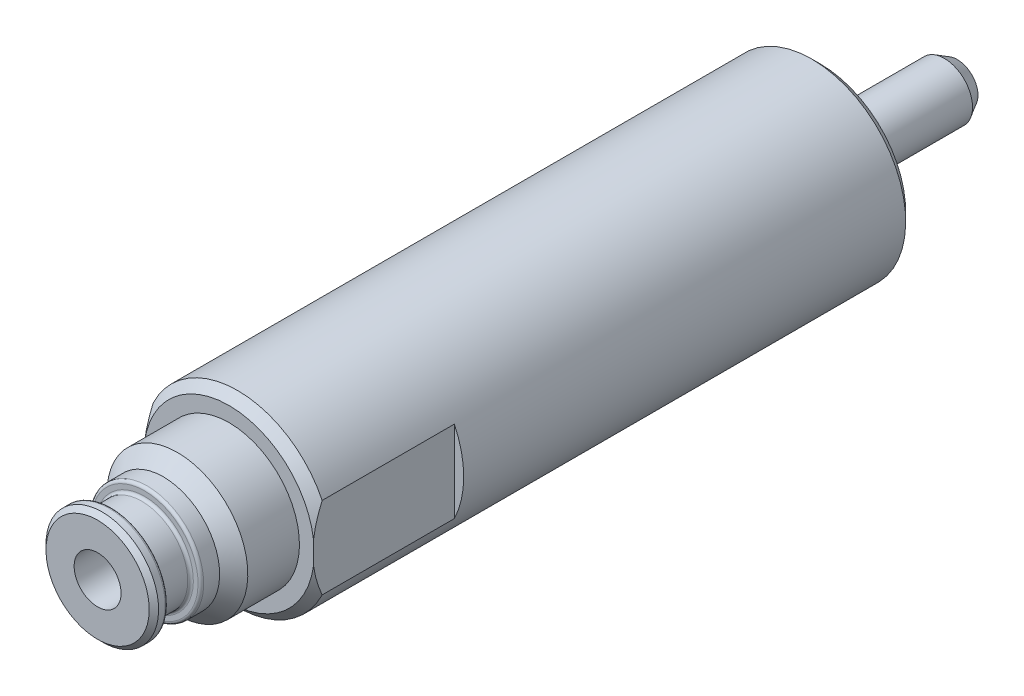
ISO-10303-21;
HEADER;
FILE_DESCRIPTION(('STEP AP214'),'2;1');
FILE_NAME('part.step','',(''),(''),'','','');
FILE_SCHEMA(('AUTOMOTIVE_DESIGN { 1 0 10303 214 1 1 1 1 }'));
ENDSEC;
DATA;
#1=APPLICATION_CONTEXT('core data for automotive mechanical design processes');
#2=APPLICATION_PROTOCOL_DEFINITION('international standard','automotive_design',2000,#1);
#3=PRODUCT_CONTEXT('',#1,'mechanical');
#4=PRODUCT('Part','Part','',(#3));
#5=PRODUCT_RELATED_PRODUCT_CATEGORY('part','',(#4));
#6=PRODUCT_DEFINITION_FORMATION('','',#4);
#7=PRODUCT_DEFINITION_CONTEXT('part definition',#1,'design');
#8=PRODUCT_DEFINITION('design','',#6,#7);
#9=PRODUCT_DEFINITION_SHAPE('','',#8);
#10=(LENGTH_UNIT() NAMED_UNIT(*) SI_UNIT(.MILLI.,.METRE.));
#11=(NAMED_UNIT(*) PLANE_ANGLE_UNIT() SI_UNIT($,.RADIAN.));
#12=(NAMED_UNIT(*) SI_UNIT($,.STERADIAN.) SOLID_ANGLE_UNIT());
#13=UNCERTAINTY_MEASURE_WITH_UNIT(LENGTH_MEASURE(1.E-05),#10,'distance_accuracy_value','');
#14=(GEOMETRIC_REPRESENTATION_CONTEXT(3) GLOBAL_UNCERTAINTY_ASSIGNED_CONTEXT((#13)) GLOBAL_UNIT_ASSIGNED_CONTEXT((#10,
#11,#12)) REPRESENTATION_CONTEXT('',''));
#15=CARTESIAN_POINT('',(0.,0.,0.));
#16=DIRECTION('',(0.,0.,1.));
#17=DIRECTION('',(1.,0.,0.));
#18=AXIS2_PLACEMENT_3D('',#15,#16,#17);
#19=CARTESIAN_POINT('',(0.,0.,0.));
#20=DIRECTION('',(0.,0.,-1.));
#21=DIRECTION('',(-1.,0.,0.));
#22=AXIS2_PLACEMENT_3D('',#19,#20,#21);
#23=CYLINDRICAL_SURFACE('',#22,3.);
#24=CARTESIAN_POINT('',(0.,0.,-13.2));
#25=DIRECTION('',(0.,0.,1.));
#26=DIRECTION('',(1.,0.,0.));
#27=AXIS2_PLACEMENT_3D('',#24,#25,#26);
#28=CIRCLE('',#27,3.);
#29=CARTESIAN_POINT('',(3.,0.,-13.2));
#30=VERTEX_POINT('',#29);
#31=EDGE_CURVE('E23',#30,#30,#28,.T.);
#32=ORIENTED_EDGE('',*,*,#31,.T.);
#33=EDGE_LOOP('',(#32));
#34=FACE_BOUND('',#33,.T.);
#35=CARTESIAN_POINT('',(0.,0.,0.));
#36=DIRECTION('',(0.,0.,1.));
#37=DIRECTION('',(1.,0.,0.));
#38=AXIS2_PLACEMENT_3D('',#35,#36,#37);
#39=CIRCLE('',#38,3.);
#40=CARTESIAN_POINT('',(3.,0.,0.));
#41=VERTEX_POINT('',#40);
#42=EDGE_CURVE('E108',#41,#41,#39,.T.);
#43=ORIENTED_EDGE('',*,*,#42,.F.);
#44=EDGE_LOOP('',(#43));
#45=FACE_BOUND('',#44,.T.);
#46=ADVANCED_FACE('F14',(#34,#45),#23,.T.);
#47=CARTESIAN_POINT('',(0.,0.,-9.));
#48=DIRECTION('',(0.,0.,-1.));
#49=DIRECTION('',(-1.,0.,0.));
#50=AXIS2_PLACEMENT_3D('',#47,#48,#49);
#51=SPHERICAL_SURFACE('',#50,6.);
#52=CARTESIAN_POINT('',(0.,0.,-14.5810746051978));
#53=DIRECTION('',(0.,0.,-1.));
#54=DIRECTION('',(0.,1.,0.));
#55=AXIS2_PLACEMENT_3D('',#52,#53,#54);
#56=CIRCLE('',#55,2.20263620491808);
#57=CARTESIAN_POINT('',(0.,2.20263620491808,-14.5810746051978));
#58=VERTEX_POINT('',#57);
#59=EDGE_CURVE('E9',#58,#58,#56,.T.);
#60=ORIENTED_EDGE('',*,*,#59,.T.);
#61=EDGE_LOOP('',(#60));
#62=FACE_BOUND('',#61,.T.);
#63=ADVANCED_FACE('F413',(#62),#51,.T.);
#64=CARTESIAN_POINT('',(0.,0.,-13.2));
#65=DIRECTION('',(0.,0.,1.));
#66=DIRECTION('',(0.,-1.,0.));
#67=AXIS2_PLACEMENT_3D('',#64,#65,#66);
#68=CONICAL_SURFACE('',#67,3.,0.523598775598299);
#69=ORIENTED_EDGE('',*,*,#59,.F.);
#70=EDGE_LOOP('',(#69));
#71=FACE_BOUND('',#70,.T.);
#72=ORIENTED_EDGE('',*,*,#31,.F.);
#73=EDGE_LOOP('',(#72));
#74=FACE_BOUND('',#73,.T.);
#75=ADVANCED_FACE('F287',(#71,#74),#68,.T.);
#76=CARTESIAN_POINT('',(2.067,0.,77.));
#77=DIRECTION('',(0.,0.,-1.));
#78=DIRECTION('',(0.,1.,0.));
#79=AXIS2_PLACEMENT_3D('',#76,#77,#78);
#80=PLANE('',#79);
#81=CARTESIAN_POINT('',(0.,0.,77.));
#82=DIRECTION('',(0.,0.,1.));
#83=DIRECTION('',(1.,0.,0.));
#84=AXIS2_PLACEMENT_3D('',#81,#82,#83);
#85=CIRCLE('',#84,2.5);
#86=CARTESIAN_POINT('',(2.5,0.,77.));
#87=VERTEX_POINT('',#86);
#88=EDGE_CURVE('E440',#87,#87,#85,.T.);
#89=ORIENTED_EDGE('',*,*,#88,.F.);
#90=EDGE_LOOP('',(#89));
#91=FACE_BOUND('',#90,.T.);
#92=CARTESIAN_POINT('',(0.,0.,77.));
#93=DIRECTION('',(0.,0.,-1.));
#94=DIRECTION('',(0.,1.,0.));
#95=AXIS2_PLACEMENT_3D('',#92,#93,#94);
#96=CIRCLE('',#95,5.5);
#97=CARTESIAN_POINT('',(0.,5.5,77.));
#98=VERTEX_POINT('',#97);
#99=EDGE_CURVE('E154',#98,#98,#96,.T.);
#100=ORIENTED_EDGE('',*,*,#99,.F.);
#101=EDGE_LOOP('',(#100));
#102=FACE_BOUND('',#101,.T.);
#103=ADVANCED_FACE('F275',(#91,#102),#80,.F.);
#104=CARTESIAN_POINT('',(0.,0.,77.));
#105=DIRECTION('',(0.,0.,-1.));
#106=DIRECTION('',(0.,1.,0.));
#107=AXIS2_PLACEMENT_3D('',#104,#105,#106);
#108=CONICAL_SURFACE('',#107,5.5,0.785398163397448);
#109=CARTESIAN_POINT('',(0.,0.,76.5));
#110=DIRECTION('',(0.,0.,-1.));
#111=DIRECTION('',(0.,1.,0.));
#112=AXIS2_PLACEMENT_3D('',#109,#110,#111);
#113=CIRCLE('',#112,6.);
#114=CARTESIAN_POINT('',(0.,6.,76.5));
#115=VERTEX_POINT('',#114);
#116=EDGE_CURVE('E151',#115,#115,#113,.T.);
#117=ORIENTED_EDGE('',*,*,#116,.F.);
#118=EDGE_LOOP('',(#117));
#119=FACE_BOUND('',#118,.T.);
#120=ORIENTED_EDGE('',*,*,#99,.T.);
#121=EDGE_LOOP('',(#120));
#122=FACE_BOUND('',#121,.T.);
#123=ADVANCED_FACE('F305',(#119,#122),#108,.T.);
#124=CARTESIAN_POINT('',(0.,0.,54.5));
#125=DIRECTION('',(0.,0.,-1.));
#126=DIRECTION('',(0.,1.,0.));
#127=AXIS2_PLACEMENT_3D('',#124,#125,#126);
#128=CYLINDRICAL_SURFACE('',#127,6.);
#129=CARTESIAN_POINT('',(0.,0.,75.8));
#130=DIRECTION('',(0.,0.,-1.));
#131=DIRECTION('',(0.,1.,0.));
#132=AXIS2_PLACEMENT_3D('',#129,#130,#131);
#133=CIRCLE('',#132,6.);
#134=CARTESIAN_POINT('',(0.,6.,75.8));
#135=VERTEX_POINT('',#134);
#136=EDGE_CURVE('E148',#135,#135,#133,.T.);
#137=ORIENTED_EDGE('',*,*,#136,.F.);
#138=EDGE_LOOP('',(#137));
#139=FACE_BOUND('',#138,.T.);
#140=ORIENTED_EDGE('',*,*,#116,.T.);
#141=EDGE_LOOP('',(#140));
#142=FACE_BOUND('',#141,.T.);
#143=ADVANCED_FACE('F310',(#139,#142),#128,.T.);
#144=CARTESIAN_POINT('',(0.,0.,75.8));
#145=DIRECTION('',(0.,0.,-1.));
#146=DIRECTION('',(0.,1.,0.));
#147=AXIS2_PLACEMENT_3D('',#144,#145,#146);
#148=TOROIDAL_SURFACE('',#147,5.7,0.300000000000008);
#149=ORIENTED_EDGE('',*,*,#136,.T.);
#150=EDGE_LOOP('',(#149));
#151=FACE_BOUND('',#150,.T.);
#152=CARTESIAN_POINT('',(0.,0.,75.5));
#153=DIRECTION('',(0.,0.,-1.));
#154=DIRECTION('',(0.,1.,0.));
#155=AXIS2_PLACEMENT_3D('',#152,#153,#154);
#156=CIRCLE('',#155,5.7);
#157=CARTESIAN_POINT('',(0.,5.7,75.5));
#158=VERTEX_POINT('',#157);
#159=EDGE_CURVE('E145',#158,#158,#156,.T.);
#160=ORIENTED_EDGE('',*,*,#159,.F.);
#161=EDGE_LOOP('',(#160));
#162=FACE_BOUND('',#161,.T.);
#163=ADVANCED_FACE('F319',(#151,#162),#148,.T.);
#164=CARTESIAN_POINT('',(5.7,0.,75.5));
#165=DIRECTION('',(0.,0.,1.));
#166=DIRECTION('',(0.,-1.,0.));
#167=AXIS2_PLACEMENT_3D('',#164,#165,#166);
#168=PLANE('',#167);
#169=CARTESIAN_POINT('',(0.,0.,75.5));
#170=DIRECTION('',(0.,0.,-1.));
#171=DIRECTION('',(0.,1.,0.));
#172=AXIS2_PLACEMENT_3D('',#169,#170,#171);
#173=CIRCLE('',#172,5.2);
#174=CARTESIAN_POINT('',(0.,5.2,75.5));
#175=VERTEX_POINT('',#174);
#176=EDGE_CURVE('E142',#175,#175,#173,.T.);
#177=ORIENTED_EDGE('',*,*,#176,.F.);
#178=EDGE_LOOP('',(#177));
#179=FACE_BOUND('',#178,.T.);
#180=ORIENTED_EDGE('',*,*,#159,.T.);
#181=EDGE_LOOP('',(#180));
#182=FACE_BOUND('',#181,.T.);
#183=ADVANCED_FACE('F327',(#179,#182),#168,.F.);
#184=CARTESIAN_POINT('',(0.,0.,75.2));
#185=DIRECTION('',(0.,0.,-1.));
#186=DIRECTION('',(0.,1.,0.));
#187=AXIS2_PLACEMENT_3D('',#184,#185,#186);
#188=TOROIDAL_SURFACE('',#187,5.2,0.299999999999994);
#189=CARTESIAN_POINT('',(0.,0.,75.2));
#190=DIRECTION('',(0.,0.,-1.));
#191=DIRECTION('',(0.,1.,0.));
#192=AXIS2_PLACEMENT_3D('',#189,#190,#191);
#193=CIRCLE('',#192,4.9);
#194=CARTESIAN_POINT('',(0.,4.9,75.2));
#195=VERTEX_POINT('',#194);
#196=EDGE_CURVE('E139',#195,#195,#193,.T.);
#197=ORIENTED_EDGE('',*,*,#196,.F.);
#198=EDGE_LOOP('',(#197));
#199=FACE_BOUND('',#198,.T.);
#200=ORIENTED_EDGE('',*,*,#176,.T.);
#201=EDGE_LOOP('',(#200));
#202=FACE_BOUND('',#201,.T.);
#203=ADVANCED_FACE('F335',(#199,#202),#188,.F.);
#204=CARTESIAN_POINT('',(0.,0.,54.5));
#205=DIRECTION('',(0.,0.,-1.));
#206=DIRECTION('',(0.,1.,0.));
#207=AXIS2_PLACEMENT_3D('',#204,#205,#206);
#208=CYLINDRICAL_SURFACE('',#207,4.9);
#209=CARTESIAN_POINT('',(0.,0.,72.3));
#210=DIRECTION('',(0.,0.,-1.));
#211=DIRECTION('',(0.,1.,0.));
#212=AXIS2_PLACEMENT_3D('',#209,#210,#211);
#213=CIRCLE('',#212,4.9);
#214=CARTESIAN_POINT('',(0.,4.9,72.3));
#215=VERTEX_POINT('',#214);
#216=EDGE_CURVE('E136',#215,#215,#213,.T.);
#217=ORIENTED_EDGE('',*,*,#216,.F.);
#218=EDGE_LOOP('',(#217));
#219=FACE_BOUND('',#218,.T.);
#220=ORIENTED_EDGE('',*,*,#196,.T.);
#221=EDGE_LOOP('',(#220));
#222=FACE_BOUND('',#221,.T.);
#223=ADVANCED_FACE('F343',(#219,#222),#208,.T.);
#224=CARTESIAN_POINT('',(0.,0.,72.3));
#225=DIRECTION('',(0.,0.,-1.));
#226=DIRECTION('',(0.,1.,0.));
#227=AXIS2_PLACEMENT_3D('',#224,#225,#226);
#228=TOROIDAL_SURFACE('',#227,5.2,0.29999999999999);
#229=CARTESIAN_POINT('',(0.,0.,72.));
#230=DIRECTION('',(0.,0.,-1.));
#231=DIRECTION('',(0.,1.,0.));
#232=AXIS2_PLACEMENT_3D('',#229,#230,#231);
#233=CIRCLE('',#232,5.2);
#234=CARTESIAN_POINT('',(0.,5.2,72.));
#235=VERTEX_POINT('',#234);
#236=EDGE_CURVE('E133',#235,#235,#233,.T.);
#237=ORIENTED_EDGE('',*,*,#236,.F.);
#238=EDGE_LOOP('',(#237));
#239=FACE_BOUND('',#238,.T.);
#240=ORIENTED_EDGE('',*,*,#216,.T.);
#241=EDGE_LOOP('',(#240));
#242=FACE_BOUND('',#241,.T.);
#243=ADVANCED_FACE('F351',(#239,#242),#228,.F.);
#244=CARTESIAN_POINT('',(5.2,0.,72.));
#245=DIRECTION('',(0.,0.,-1.));
#246=DIRECTION('',(0.,1.,0.));
#247=AXIS2_PLACEMENT_3D('',#244,#245,#246);
#248=PLANE('',#247);
#249=CARTESIAN_POINT('',(0.,0.,72.));
#250=DIRECTION('',(0.,0.,-1.));
#251=DIRECTION('',(0.,1.,0.));
#252=AXIS2_PLACEMENT_3D('',#249,#250,#251);
#253=CIRCLE('',#252,5.7);
#254=CARTESIAN_POINT('',(0.,5.7,72.));
#255=VERTEX_POINT('',#254);
#256=EDGE_CURVE('E130',#255,#255,#253,.T.);
#257=ORIENTED_EDGE('',*,*,#256,.F.);
#258=EDGE_LOOP('',(#257));
#259=FACE_BOUND('',#258,.T.);
#260=ORIENTED_EDGE('',*,*,#236,.T.);
#261=EDGE_LOOP('',(#260));
#262=FACE_BOUND('',#261,.T.);
#263=ADVANCED_FACE('F359',(#259,#262),#248,.F.);
#264=CARTESIAN_POINT('',(0.,0.,71.7));
#265=DIRECTION('',(0.,0.,-1.));
#266=DIRECTION('',(0.,1.,0.));
#267=AXIS2_PLACEMENT_3D('',#264,#265,#266);
#268=TOROIDAL_SURFACE('',#267,5.7,0.300000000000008);
#269=ORIENTED_EDGE('',*,*,#256,.T.);
#270=EDGE_LOOP('',(#269));
#271=FACE_BOUND('',#270,.T.);
#272=CARTESIAN_POINT('',(0.,0.,71.7));
#273=DIRECTION('',(0.,0.,-1.));
#274=DIRECTION('',(0.,1.,0.));
#275=AXIS2_PLACEMENT_3D('',#272,#273,#274);
#276=CIRCLE('',#275,6.);
#277=CARTESIAN_POINT('',(0.,6.,71.7));
#278=VERTEX_POINT('',#277);
#279=EDGE_CURVE('E127',#278,#278,#276,.T.);
#280=ORIENTED_EDGE('',*,*,#279,.F.);
#281=EDGE_LOOP('',(#280));
#282=FACE_BOUND('',#281,.T.);
#283=ADVANCED_FACE('F367',(#271,#282),#268,.T.);
#284=CARTESIAN_POINT('',(0.,0.,54.5));
#285=DIRECTION('',(0.,0.,-1.));
#286=DIRECTION('',(0.,1.,0.));
#287=AXIS2_PLACEMENT_3D('',#284,#285,#286);
#288=CYLINDRICAL_SURFACE('',#287,6.);
#289=CARTESIAN_POINT('',(0.,0.,70.));
#290=DIRECTION('',(0.,0.,-1.));
#291=DIRECTION('',(0.,1.,0.));
#292=AXIS2_PLACEMENT_3D('',#289,#290,#291);
#293=CIRCLE('',#292,6.);
#294=CARTESIAN_POINT('',(0.,6.,70.));
#295=VERTEX_POINT('',#294);
#296=EDGE_CURVE('E124',#295,#295,#293,.T.);
#297=ORIENTED_EDGE('',*,*,#296,.F.);
#298=EDGE_LOOP('',(#297));
#299=FACE_BOUND('',#298,.T.);
#300=ORIENTED_EDGE('',*,*,#279,.T.);
#301=EDGE_LOOP('',(#300));
#302=FACE_BOUND('',#301,.T.);
#303=ADVANCED_FACE('F375',(#299,#302),#288,.T.);
#304=CARTESIAN_POINT('',(0.,0.,70.));
#305=DIRECTION('',(0.,0.,-1.));
#306=DIRECTION('',(0.,1.,0.));
#307=AXIS2_PLACEMENT_3D('',#304,#305,#306);
#308=CONICAL_SURFACE('',#307,6.,0.785398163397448);
#309=CARTESIAN_POINT('',(0.,0.,68.5));
#310=DIRECTION('',(0.,0.,-1.));
#311=DIRECTION('',(0.,1.,0.));
#312=AXIS2_PLACEMENT_3D('',#309,#310,#311);
#313=CIRCLE('',#312,7.5);
#314=CARTESIAN_POINT('',(0.,7.5,68.5));
#315=VERTEX_POINT('',#314);
#316=EDGE_CURVE('E121',#315,#315,#313,.T.);
#317=ORIENTED_EDGE('',*,*,#316,.F.);
#318=EDGE_LOOP('',(#317));
#319=FACE_BOUND('',#318,.T.);
#320=ORIENTED_EDGE('',*,*,#296,.T.);
#321=EDGE_LOOP('',(#320));
#322=FACE_BOUND('',#321,.T.);
#323=ADVANCED_FACE('F192',(#319,#322),#308,.T.);
#324=CARTESIAN_POINT('',(0.,0.,54.5));
#325=DIRECTION('',(0.,0.,-1.));
#326=DIRECTION('',(0.,1.,0.));
#327=AXIS2_PLACEMENT_3D('',#324,#325,#326);
#328=CYLINDRICAL_SURFACE('',#327,7.5);
#329=CARTESIAN_POINT('',(0.,0.,63.));
#330=DIRECTION('',(0.,0.,-1.));
#331=DIRECTION('',(0.,1.,0.));
#332=AXIS2_PLACEMENT_3D('',#329,#330,#331);
#333=CIRCLE('',#332,7.5);
#334=CARTESIAN_POINT('',(0.,7.5,63.));
#335=VERTEX_POINT('',#334);
#336=EDGE_CURVE('E95',#335,#335,#333,.T.);
#337=ORIENTED_EDGE('',*,*,#336,.F.);
#338=EDGE_LOOP('',(#337));
#339=FACE_BOUND('',#338,.T.);
#340=ORIENTED_EDGE('',*,*,#316,.T.);
#341=EDGE_LOOP('',(#340));
#342=FACE_BOUND('',#341,.T.);
#343=ADVANCED_FACE('F182',(#339,#342),#328,.T.);
#344=CARTESIAN_POINT('',(9.08,0.,63.));
#345=DIRECTION('',(0.,0.,1.));
#346=DIRECTION('',(0.,-1.,0.));
#347=AXIS2_PLACEMENT_3D('',#344,#345,#346);
#348=PLANE('',#347);
#349=ORIENTED_EDGE('',*,*,#336,.T.);
#350=EDGE_LOOP('',(#349));
#351=FACE_BOUND('',#350,.T.);
#352=CARTESIAN_POINT('',(0.,0.,63.));
#353=DIRECTION('',(0.,0.,-1.));
#354=DIRECTION('',(0.,1.,0.));
#355=AXIS2_PLACEMENT_3D('',#352,#353,#354);
#356=CIRCLE('',#355,9.08);
#357=CARTESIAN_POINT('',(-9.,1.20266371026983,63.));
#358=VERTEX_POINT('',#357);
#359=CARTESIAN_POINT('',(9.,1.20266371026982,63.));
#360=VERTEX_POINT('',#359);
#361=EDGE_CURVE('E92',#358,#360,#356,.T.);
#362=ORIENTED_EDGE('',*,*,#361,.F.);
#363=DIRECTION('',(0.,-1.,0.));
#364=VECTOR('',#363,1.);
#365=CARTESIAN_POINT('',(-9.,0.,63.));
#366=LINE('',#365,#364);
#367=CARTESIAN_POINT('',(-9.,-1.20266371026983,63.));
#368=VERTEX_POINT('',#367);
#369=EDGE_CURVE('E78',#358,#368,#366,.T.);
#370=ORIENTED_EDGE('',*,*,#369,.T.);
#371=CARTESIAN_POINT('',(9.,-1.20266371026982,63.));
#372=VERTEX_POINT('',#371);
#373=EDGE_CURVE('E85',#372,#368,#356,.T.);
#374=ORIENTED_EDGE('',*,*,#373,.F.);
#375=DIRECTION('',(0.,1.,0.));
#376=VECTOR('',#375,1.);
#377=CARTESIAN_POINT('',(9.,0.,63.));
#378=LINE('',#377,#376);
#379=EDGE_CURVE('E68',#372,#360,#378,.T.);
#380=ORIENTED_EDGE('',*,*,#379,.T.);
#381=EDGE_LOOP('',(#362,#370,#374,#380));
#382=FACE_BOUND('',#381,.T.);
#383=ADVANCED_FACE('F90',(#351,#382),#348,.T.);
#384=CARTESIAN_POINT('',(0.,0.,62.08));
#385=DIRECTION('',(0.,0.,-1.));
#386=DIRECTION('',(0.,1.,0.));
#387=AXIS2_PLACEMENT_3D('',#384,#385,#386);
#388=CONICAL_SURFACE('',#387,10.,0.785398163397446);
#389=CARTESIAN_POINT('',(0.,0.,62.08));
#390=DIRECTION('',(0.,0.,-1.));
#391=DIRECTION('',(0.,1.,0.));
#392=AXIS2_PLACEMENT_3D('',#389,#390,#391);
#393=CIRCLE('',#392,10.);
#394=CARTESIAN_POINT('',(-9.,4.35889894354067,62.08));
#395=VERTEX_POINT('',#394);
#396=CARTESIAN_POINT('',(9.,4.35889894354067,62.08));
#397=VERTEX_POINT('',#396);
#398=EDGE_CURVE('E91',#395,#397,#393,.T.);
#399=ORIENTED_EDGE('',*,*,#398,.F.);
#400=CARTESIAN_POINT('',(-9.,20.0889844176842,50.0671107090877));
#401=CARTESIAN_POINT('',(-9.,19.7941845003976,50.3361376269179));
#402=CARTESIAN_POINT('',(-9.,19.49889874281,50.6046332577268));
#403=CARTESIAN_POINT('',(-9.,18.9072134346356,51.1403994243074));
#404=CARTESIAN_POINT('',(-9.,18.6108138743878,51.4076699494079));
#405=CARTESIAN_POINT('',(-9.,18.016689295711,51.9408857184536));
#406=CARTESIAN_POINT('',(-9.,17.7189639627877,52.2068306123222));
#407=CARTESIAN_POINT('',(-9.,17.1220890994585,52.7371142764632));
#408=CARTESIAN_POINT('',(-9.,16.822939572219,53.0014530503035));
#409=CARTESIAN_POINT('',(-9.,15.9186985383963,53.7955547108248));
#410=CARTESIAN_POINT('',(-9.,15.3111326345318,54.3225158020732));
#411=CARTESIAN_POINT('',(-9.,14.3932925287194,55.1052669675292));
#412=CARTESIAN_POINT('',(-9.,14.0862824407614,55.3648870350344));
#413=CARTESIAN_POINT('',(-9.,13.4697157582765,55.881088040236));
#414=CARTESIAN_POINT('',(-9.,13.1601591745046,56.1376689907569));
#415=CARTESIAN_POINT('',(-9.,12.5849192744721,56.6088254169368));
#416=CARTESIAN_POINT('',(-9.,12.3196505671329,56.8239068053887));
#417=CARTESIAN_POINT('',(-9.,11.7866455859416,57.2509886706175));
#418=CARTESIAN_POINT('',(-9.,11.5189093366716,57.4629891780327));
#419=CARTESIAN_POINT('',(-9.,10.9804995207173,57.8834133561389));
#420=CARTESIAN_POINT('',(-9.,10.7098250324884,58.0918358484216));
#421=CARTESIAN_POINT('',(-9.,10.165171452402,58.5043204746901));
#422=CARTESIAN_POINT('',(-9.,9.89119239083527,58.7083826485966));
#423=CARTESIAN_POINT('',(-9.,9.33978293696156,59.1109565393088));
#424=CARTESIAN_POINT('',(-9.,9.06235809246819,59.309475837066));
#425=CARTESIAN_POINT('',(-9.,8.50301529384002,59.7001296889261));
#426=CARTESIAN_POINT('',(-9.,8.22109712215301,59.8922639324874));
#427=CARTESIAN_POINT('',(-9.,7.65217834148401,60.2685512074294));
#428=CARTESIAN_POINT('',(-9.,7.36518050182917,60.4527084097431));
#429=CARTESIAN_POINT('',(-9.,6.78513344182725,60.8111918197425));
#430=CARTESIAN_POINT('',(-9.,6.49208508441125,60.9855194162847));
#431=CARTESIAN_POINT('',(-9.,5.90679788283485,61.317393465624));
#432=CARTESIAN_POINT('',(-9.,5.6147426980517,61.4752618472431));
#433=CARTESIAN_POINT('',(-9.,5.02305416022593,61.7763015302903));
#434=CARTESIAN_POINT('',(-9.,4.72342010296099,61.9194714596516));
#435=CARTESIAN_POINT('',(-9.,4.11636189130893,62.1870563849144));
#436=CARTESIAN_POINT('',(-9.,3.80895049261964,62.3115000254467));
#437=CARTESIAN_POINT('',(-9.,3.18569208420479,62.5372331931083));
#438=CARTESIAN_POINT('',(-9.,2.86984745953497,62.6385291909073));
#439=CARTESIAN_POINT('',(-9.,2.29142781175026,62.7962123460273));
#440=CARTESIAN_POINT('',(-9.,2.03019136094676,62.8574808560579));
#441=CARTESIAN_POINT('',(-9.,1.50362674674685,62.958913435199));
#442=CARTESIAN_POINT('',(-9.,1.23829917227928,62.9990805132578));
#443=CARTESIAN_POINT('',(-9.,0.705706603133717,63.0562472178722));
#444=CARTESIAN_POINT('',(-9.,0.438447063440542,63.0732969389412));
#445=CARTESIAN_POINT('',(-9.,-0.0965355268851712,63.0834560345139));
#446=CARTESIAN_POINT('',(-9.,-0.364258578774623,63.0765653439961));
#447=CARTESIAN_POINT('',(-9.,-0.897547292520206,63.03926235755));
#448=CARTESIAN_POINT('',(-9.,-1.16311598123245,63.0088926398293));
#449=CARTESIAN_POINT('',(-9.,-1.69079838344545,62.9262664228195));
#450=CARTESIAN_POINT('',(-9.,-1.9529118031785,62.8740080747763));
#451=CARTESIAN_POINT('',(-9.,-2.47314253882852,62.7498122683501));
#452=CARTESIAN_POINT('',(-9.,-2.73124679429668,62.6778207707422));
#453=CARTESIAN_POINT('',(-9.,-3.24205693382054,62.516938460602));
#454=CARTESIAN_POINT('',(-9.,-3.49476303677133,62.4280483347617));
#455=CARTESIAN_POINT('',(-9.,-4.07604409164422,62.2047542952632));
#456=CARTESIAN_POINT('',(-9.,-4.40253716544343,62.0649539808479));
#457=CARTESIAN_POINT('',(-9.,-5.04645154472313,61.7656734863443));
#458=CARTESIAN_POINT('',(-9.,-5.36386785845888,61.6061827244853));
#459=CARTESIAN_POINT('',(-9.,-5.99110227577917,61.271539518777));
#460=CARTESIAN_POINT('',(-9.,-6.30090358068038,61.0963558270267));
#461=CARTESIAN_POINT('',(-9.,-6.91327229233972,60.7339678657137));
#462=CARTESIAN_POINT('',(-9.,-7.21584094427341,60.5467656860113));
#463=CARTESIAN_POINT('',(-9.,-7.81811190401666,60.1607348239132));
#464=CARTESIAN_POINT('',(-9.,-8.11774682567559,59.961801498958));
#465=CARTESIAN_POINT('',(-9.,-8.71169811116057,59.5561568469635));
#466=CARTESIAN_POINT('',(-9.,-9.00601430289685,59.3494452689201));
#467=CARTESIAN_POINT('',(-9.,-9.58977868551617,58.9299922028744));
#468=CARTESIAN_POINT('',(-9.,-9.87923221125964,58.7172581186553));
#469=CARTESIAN_POINT('',(-9.,-10.4543036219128,58.2866619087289));
#470=CARTESIAN_POINT('',(-9.,-10.7399213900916,58.0687996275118));
#471=CARTESIAN_POINT('',(-9.,-11.4242974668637,57.5386678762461));
#472=CARTESIAN_POINT('',(-9.,-11.8214368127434,57.2243100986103));
#473=CARTESIAN_POINT('',(-9.,-12.6104586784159,56.5890670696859));
#474=CARTESIAN_POINT('',(-9.,-13.0023410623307,56.268181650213));
#475=CARTESIAN_POINT('',(-9.,-13.7819938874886,55.6210793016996));
#476=CARTESIAN_POINT('',(-9.,-14.1697622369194,55.2948598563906));
#477=CARTESIAN_POINT('',(-9.,-14.9417496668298,54.6382482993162));
#478=CARTESIAN_POINT('',(-9.,-15.3259687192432,54.3078561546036));
#479=CARTESIAN_POINT('',(-9.,-16.0783900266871,53.6549933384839));
#480=CARTESIAN_POINT('',(-9.,-16.4466915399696,53.3326369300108));
#481=CARTESIAN_POINT('',(-9.,-17.1809601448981,52.6852740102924));
#482=CARTESIAN_POINT('',(-9.,-17.5469272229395,52.3602674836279));
#483=CARTESIAN_POINT('',(-9.,-18.2765566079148,51.7083120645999));
#484=CARTESIAN_POINT('',(-9.,-18.6402206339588,51.3813650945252));
#485=CARTESIAN_POINT('',(-9.,-19.3658255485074,50.725578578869));
#486=CARTESIAN_POINT('',(-9.,-19.7277664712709,50.3967390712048));
#487=CARTESIAN_POINT('',(-9.,-20.0889844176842,50.0671107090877));
#488=B_SPLINE_CURVE_WITH_KNOTS('',3,(#400,#401,#402,#403,#404,#405,#406,#407,#408,#409,#410,
#411,#412,#413,#414,#415,#416,#417,#418,#419,#420,#421,#422,#423,#424,#425,#426,#427,#428,#429,
#430,#431,#432,#433,#434,#435,#436,#437,#438,#439,#440,#441,#442,#443,#444,#445,#446,#447,#448,
#449,#450,#451,#452,#453,#454,#455,#456,#457,#458,#459,#460,#461,#462,#463,#464,#465,#466,#467,
#468,#469,#470,#471,#472,#473,#474,#475,#476,#477,#478,#479,#480,#481,#482,#483,#484,#485,#486,
#487),.UNSPECIFIED.,.F.,.F.,(4,2,2,2,2,2,2,2,2,2,2,2,2,2,2,2,2,2,2,2,2,2,2,2,2,2,2,2,2,2,2,2,2,
2,2,2,2,2,2,2,2,2,2,4),(0.,1.19730659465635,2.3946235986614,3.59224161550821,4.78985697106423,
7.20251667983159,8.40870278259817,9.61488379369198,10.6393878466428,11.6638817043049,
12.6887067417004,13.7135223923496,14.7368599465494,15.7602471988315,16.7830927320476,
17.8057933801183,18.8014398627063,19.7971792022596,20.7913795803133,21.7853016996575,
22.5895213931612,23.3936263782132,24.195986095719,24.9983479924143,25.7992582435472,
26.6002361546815,27.4034298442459,28.2065909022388,29.2712072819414,30.3363983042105,
31.403759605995,32.4709358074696,33.5497661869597,34.6286314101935,35.7062234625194,
36.7838482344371,38.3032478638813,39.8226866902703,41.3428642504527,42.8630538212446,
44.3313839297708,45.7997225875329,47.2667917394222,48.7338316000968),.UNSPECIFIED.);
#489=EDGE_CURVE('E198',#395,#358,#488,.T.);
#490=ORIENTED_EDGE('',*,*,#489,.T.);
#491=ORIENTED_EDGE('',*,*,#361,.T.);
#492=CARTESIAN_POINT('',(9.,-20.0889844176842,50.0671107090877));
#493=CARTESIAN_POINT('',(9.,-19.7941845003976,50.3361376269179));
#494=CARTESIAN_POINT('',(9.,-19.49889874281,50.6046332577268));
#495=CARTESIAN_POINT('',(9.,-18.9072134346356,51.1403994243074));
#496=CARTESIAN_POINT('',(9.,-18.6108138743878,51.4076699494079));
#497=CARTESIAN_POINT('',(9.,-18.016689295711,51.9408857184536));
#498=CARTESIAN_POINT('',(9.,-17.7189639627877,52.2068306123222));
#499=CARTESIAN_POINT('',(9.,-17.1220890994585,52.7371142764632));
#500=CARTESIAN_POINT('',(9.,-16.822939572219,53.0014530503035));
#501=CARTESIAN_POINT('',(9.,-15.9186985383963,53.7955547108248));
#502=CARTESIAN_POINT('',(9.,-15.3111326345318,54.3225158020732));
#503=CARTESIAN_POINT('',(9.,-14.3932925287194,55.1052669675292));
#504=CARTESIAN_POINT('',(9.,-14.0862824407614,55.3648870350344));
#505=CARTESIAN_POINT('',(9.,-13.4697157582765,55.881088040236));
#506=CARTESIAN_POINT('',(9.,-13.1601591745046,56.1376689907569));
#507=CARTESIAN_POINT('',(9.,-12.5849192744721,56.6088254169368));
#508=CARTESIAN_POINT('',(9.,-12.3196505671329,56.8239068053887));
#509=CARTESIAN_POINT('',(9.,-11.7866455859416,57.2509886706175));
#510=CARTESIAN_POINT('',(9.,-11.5189093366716,57.4629891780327));
#511=CARTESIAN_POINT('',(9.,-10.9804995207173,57.8834133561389));
#512=CARTESIAN_POINT('',(9.,-10.7098250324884,58.0918358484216));
#513=CARTESIAN_POINT('',(9.,-10.165171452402,58.5043204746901));
#514=CARTESIAN_POINT('',(9.,-9.89119239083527,58.7083826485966));
#515=CARTESIAN_POINT('',(9.,-9.33978293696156,59.1109565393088));
#516=CARTESIAN_POINT('',(9.,-9.06235809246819,59.309475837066));
#517=CARTESIAN_POINT('',(9.,-8.50301529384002,59.7001296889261));
#518=CARTESIAN_POINT('',(9.,-8.22109712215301,59.8922639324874));
#519=CARTESIAN_POINT('',(9.,-7.65217834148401,60.2685512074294));
#520=CARTESIAN_POINT('',(9.,-7.36518050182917,60.4527084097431));
#521=CARTESIAN_POINT('',(9.,-6.78513344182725,60.8111918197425));
#522=CARTESIAN_POINT('',(9.,-6.49208508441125,60.9855194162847));
#523=CARTESIAN_POINT('',(9.,-5.90679788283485,61.317393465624));
#524=CARTESIAN_POINT('',(9.,-5.6147426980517,61.4752618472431));
#525=CARTESIAN_POINT('',(9.,-5.02305416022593,61.7763015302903));
#526=CARTESIAN_POINT('',(9.,-4.72342010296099,61.9194714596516));
#527=CARTESIAN_POINT('',(9.,-4.11636189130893,62.1870563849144));
#528=CARTESIAN_POINT('',(9.,-3.80895049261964,62.3115000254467));
#529=CARTESIAN_POINT('',(9.,-3.18569208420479,62.5372331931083));
#530=CARTESIAN_POINT('',(9.,-2.86984745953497,62.6385291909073));
#531=CARTESIAN_POINT('',(9.,-2.29142781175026,62.7962123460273));
#532=CARTESIAN_POINT('',(9.,-2.03019136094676,62.8574808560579));
#533=CARTESIAN_POINT('',(9.,-1.50362674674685,62.958913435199));
#534=CARTESIAN_POINT('',(9.,-1.23829917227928,62.9990805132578));
#535=CARTESIAN_POINT('',(9.,-0.705706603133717,63.0562472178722));
#536=CARTESIAN_POINT('',(9.,-0.438447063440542,63.0732969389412));
#537=CARTESIAN_POINT('',(9.,0.0965355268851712,63.0834560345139));
#538=CARTESIAN_POINT('',(9.,0.364258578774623,63.0765653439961));
#539=CARTESIAN_POINT('',(9.,0.897547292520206,63.03926235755));
#540=CARTESIAN_POINT('',(9.,1.16311598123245,63.0088926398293));
#541=CARTESIAN_POINT('',(9.,1.69079838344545,62.9262664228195));
#542=CARTESIAN_POINT('',(9.,1.9529118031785,62.8740080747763));
#543=CARTESIAN_POINT('',(9.,2.47314253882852,62.7498122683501));
#544=CARTESIAN_POINT('',(9.,2.73124679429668,62.6778207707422));
#545=CARTESIAN_POINT('',(9.,3.24205693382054,62.516938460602));
#546=CARTESIAN_POINT('',(9.,3.49476303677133,62.4280483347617));
#547=CARTESIAN_POINT('',(9.,4.07604409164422,62.2047542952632));
#548=CARTESIAN_POINT('',(9.,4.40253716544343,62.0649539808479));
#549=CARTESIAN_POINT('',(9.,5.04645154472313,61.7656734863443));
#550=CARTESIAN_POINT('',(9.,5.36386785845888,61.6061827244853));
#551=CARTESIAN_POINT('',(9.,5.99110227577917,61.271539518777));
#552=CARTESIAN_POINT('',(9.,6.30090358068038,61.0963558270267));
#553=CARTESIAN_POINT('',(9.,6.91327229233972,60.7339678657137));
#554=CARTESIAN_POINT('',(9.,7.21584094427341,60.5467656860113));
#555=CARTESIAN_POINT('',(9.,7.81811190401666,60.1607348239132));
#556=CARTESIAN_POINT('',(9.,8.11774682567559,59.961801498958));
#557=CARTESIAN_POINT('',(9.,8.71169811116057,59.5561568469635));
#558=CARTESIAN_POINT('',(9.,9.00601430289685,59.3494452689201));
#559=CARTESIAN_POINT('',(9.,9.58977868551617,58.9299922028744));
#560=CARTESIAN_POINT('',(9.,9.87923221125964,58.7172581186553));
#561=CARTESIAN_POINT('',(9.,10.4543036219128,58.2866619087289));
#562=CARTESIAN_POINT('',(9.,10.7399213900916,58.0687996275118));
#563=CARTESIAN_POINT('',(9.,11.4242974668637,57.5386678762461));
#564=CARTESIAN_POINT('',(9.,11.8214368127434,57.2243100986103));
#565=CARTESIAN_POINT('',(9.,12.6104586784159,56.5890670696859));
#566=CARTESIAN_POINT('',(9.,13.0023410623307,56.268181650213));
#567=CARTESIAN_POINT('',(9.,13.7819938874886,55.6210793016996));
#568=CARTESIAN_POINT('',(9.,14.1697622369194,55.2948598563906));
#569=CARTESIAN_POINT('',(9.,14.9417496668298,54.6382482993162));
#570=CARTESIAN_POINT('',(9.,15.3259687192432,54.3078561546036));
#571=CARTESIAN_POINT('',(9.,16.0783900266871,53.6549933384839));
#572=CARTESIAN_POINT('',(9.,16.4466915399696,53.3326369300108));
#573=CARTESIAN_POINT('',(9.,17.1809601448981,52.6852740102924));
#574=CARTESIAN_POINT('',(9.,17.5469272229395,52.3602674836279));
#575=CARTESIAN_POINT('',(9.,18.2765566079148,51.7083120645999));
#576=CARTESIAN_POINT('',(9.,18.6402206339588,51.3813650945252));
#577=CARTESIAN_POINT('',(9.,19.3658255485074,50.725578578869));
#578=CARTESIAN_POINT('',(9.,19.7277664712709,50.3967390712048));
#579=CARTESIAN_POINT('',(9.,20.0889844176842,50.0671107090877));
#580=B_SPLINE_CURVE_WITH_KNOTS('',3,(#492,#493,#494,#495,#496,#497,#498,#499,#500,#501,#502,
#503,#504,#505,#506,#507,#508,#509,#510,#511,#512,#513,#514,#515,#516,#517,#518,#519,#520,#521,
#522,#523,#524,#525,#526,#527,#528,#529,#530,#531,#532,#533,#534,#535,#536,#537,#538,#539,#540,
#541,#542,#543,#544,#545,#546,#547,#548,#549,#550,#551,#552,#553,#554,#555,#556,#557,#558,#559,
#560,#561,#562,#563,#564,#565,#566,#567,#568,#569,#570,#571,#572,#573,#574,#575,#576,#577,#578,
#579),.UNSPECIFIED.,.F.,.F.,(4,2,2,2,2,2,2,2,2,2,2,2,2,2,2,2,2,2,2,2,2,2,2,2,2,2,2,2,2,2,2,2,2,
2,2,2,2,2,2,2,2,2,2,4),(0.,1.19730659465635,2.3946235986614,3.59224161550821,4.78985697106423,
7.20251667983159,8.40870278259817,9.61488379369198,10.6393878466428,11.6638817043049,
12.6887067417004,13.7135223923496,14.7368599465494,15.7602471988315,16.7830927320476,
17.8057933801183,18.8014398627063,19.7971792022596,20.7913795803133,21.7853016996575,
22.5895213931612,23.3936263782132,24.195986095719,24.9983479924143,25.7992582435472,
26.6002361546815,27.4034298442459,28.2065909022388,29.2712072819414,30.3363983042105,
31.403759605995,32.4709358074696,33.5497661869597,34.6286314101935,35.7062234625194,
36.7838482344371,38.3032478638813,39.8226866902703,41.3428642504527,42.8630538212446,
44.3313839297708,45.7997225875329,47.2667917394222,48.7338316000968),.UNSPECIFIED.);
#581=EDGE_CURVE('E31',#360,#397,#580,.T.);
#582=ORIENTED_EDGE('',*,*,#581,.T.);
#583=EDGE_LOOP('',(#399,#490,#491,#582));
#584=FACE_BOUND('',#583,.T.);
#585=ADVANCED_FACE('F169',(#584),#388,.T.);
#586=CARTESIAN_POINT('',(0.,0.,48.));
#587=DIRECTION('',(0.,0.,1.));
#588=DIRECTION('',(0.,-1.,0.));
#589=AXIS2_PLACEMENT_3D('',#586,#587,#588);
#590=PLANE('',#589);
#591=DIRECTION('',(0.,-1.,0.));
#592=VECTOR('',#591,1.);
#593=CARTESIAN_POINT('',(-9.,10.,48.));
#594=LINE('',#593,#592);
#595=CARTESIAN_POINT('',(-9.,4.35889894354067,48.));
#596=VERTEX_POINT('',#595);
#597=CARTESIAN_POINT('',(-9.,-4.35889894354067,48.));
#598=VERTEX_POINT('',#597);
#599=EDGE_CURVE('E159',#596,#598,#594,.T.);
#600=ORIENTED_EDGE('',*,*,#599,.F.);
#601=CARTESIAN_POINT('',(0.,0.,48.));
#602=DIRECTION('',(0.,0.,1.));
#603=DIRECTION('',(0.,-1.,0.));
#604=AXIS2_PLACEMENT_3D('',#601,#602,#603);
#605=CIRCLE('',#604,10.);
#606=EDGE_CURVE('E104',#598,#596,#605,.F.);
#607=ORIENTED_EDGE('',*,*,#606,.F.);
#608=EDGE_LOOP('',(#600,#607));
#609=FACE_BOUND('',#608,.T.);
#610=ADVANCED_FACE('F190',(#609),#590,.T.);
#611=CARTESIAN_POINT('',(-9.,10.,48.));
#612=DIRECTION('',(-1.,0.,0.));
#613=DIRECTION('',(0.,-1.,0.));
#614=AXIS2_PLACEMENT_3D('',#611,#612,#613);
#615=PLANE('',#614);
#616=ORIENTED_EDGE('',*,*,#599,.T.);
#617=DIRECTION('',(0.,0.,-1.));
#618=VECTOR('',#617,1.);
#619=CARTESIAN_POINT('',(-9.,-4.35889894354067,0.));
#620=LINE('',#619,#618);
#621=CARTESIAN_POINT('',(-9.,-4.35889894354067,62.08));
#622=VERTEX_POINT('',#621);
#623=EDGE_CURVE('E201',#622,#598,#620,.T.);
#624=ORIENTED_EDGE('',*,*,#623,.F.);
#625=EDGE_CURVE('E39',#368,#622,#488,.T.);
#626=ORIENTED_EDGE('',*,*,#625,.F.);
#627=ORIENTED_EDGE('',*,*,#369,.F.);
#628=ORIENTED_EDGE('',*,*,#489,.F.);
#629=DIRECTION('',(0.,0.,-1.));
#630=VECTOR('',#629,1.);
#631=CARTESIAN_POINT('',(-9.,4.35889894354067,0.));
#632=LINE('',#631,#630);
#633=EDGE_CURVE('E197',#596,#395,#632,.F.);
#634=ORIENTED_EDGE('',*,*,#633,.F.);
#635=EDGE_LOOP('',(#616,#624,#626,#627,#628,#634));
#636=FACE_BOUND('',#635,.T.);
#637=ADVANCED_FACE('F178',(#636),#615,.T.);
#638=ORIENTED_EDGE('',*,*,#373,.T.);
#639=ORIENTED_EDGE('',*,*,#625,.T.);
#640=CARTESIAN_POINT('',(9.,-4.35889894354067,62.08));
#641=VERTEX_POINT('',#640);
#642=EDGE_CURVE('E86',#641,#622,#393,.T.);
#643=ORIENTED_EDGE('',*,*,#642,.F.);
#644=EDGE_CURVE('E72',#641,#372,#580,.T.);
#645=ORIENTED_EDGE('',*,*,#644,.T.);
#646=EDGE_LOOP('',(#638,#639,#643,#645));
#647=FACE_BOUND('',#646,.T.);
#648=ADVANCED_FACE('F84',(#647),#388,.T.);
#649=DIRECTION('',(0.,1.,0.));
#650=VECTOR('',#649,1.);
#651=CARTESIAN_POINT('',(9.,-10.,48.));
#652=LINE('',#651,#650);
#653=CARTESIAN_POINT('',(9.,-4.35889894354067,48.));
#654=VERTEX_POINT('',#653);
#655=CARTESIAN_POINT('',(9.,4.35889894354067,48.));
#656=VERTEX_POINT('',#655);
#657=EDGE_CURVE('E157',#654,#656,#652,.T.);
#658=ORIENTED_EDGE('',*,*,#657,.F.);
#659=EDGE_CURVE('E18',#656,#654,#605,.F.);
#660=ORIENTED_EDGE('',*,*,#659,.F.);
#661=EDGE_LOOP('',(#658,#660));
#662=FACE_BOUND('',#661,.T.);
#663=ADVANCED_FACE('F177',(#662),#590,.T.);
#664=CARTESIAN_POINT('',(9.,-10.,48.));
#665=DIRECTION('',(1.,0.,0.));
#666=DIRECTION('',(0.,1.,0.));
#667=AXIS2_PLACEMENT_3D('',#664,#665,#666);
#668=PLANE('',#667);
#669=ORIENTED_EDGE('',*,*,#657,.T.);
#670=DIRECTION('',(0.,0.,-1.));
#671=VECTOR('',#670,1.);
#672=CARTESIAN_POINT('',(9.,4.35889894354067,0.));
#673=LINE('',#672,#671);
#674=EDGE_CURVE('E88',#397,#656,#673,.T.);
#675=ORIENTED_EDGE('',*,*,#674,.F.);
#676=ORIENTED_EDGE('',*,*,#581,.F.);
#677=ORIENTED_EDGE('',*,*,#379,.F.);
#678=ORIENTED_EDGE('',*,*,#644,.F.);
#679=DIRECTION('',(0.,0.,-1.));
#680=VECTOR('',#679,1.);
#681=CARTESIAN_POINT('',(9.,-4.35889894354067,0.));
#682=LINE('',#681,#680);
#683=EDGE_CURVE('E87',#654,#641,#682,.F.);
#684=ORIENTED_EDGE('',*,*,#683,.F.);
#685=EDGE_LOOP('',(#669,#675,#676,#677,#678,#684));
#686=FACE_BOUND('',#685,.T.);
#687=ADVANCED_FACE('F71',(#686),#668,.T.);
#688=CARTESIAN_POINT('',(0.,0.,0.));
#689=DIRECTION('',(0.,0.,-1.));
#690=DIRECTION('',(0.,1.,0.));
#691=AXIS2_PLACEMENT_3D('',#688,#689,#690);
#692=CYLINDRICAL_SURFACE('',#691,10.);
#693=CARTESIAN_POINT('',(0.,0.,0.92));
#694=DIRECTION('',(0.,0.,-1.));
#695=DIRECTION('',(0.,1.,0.));
#696=AXIS2_PLACEMENT_3D('',#693,#694,#695);
#697=CIRCLE('',#696,10.);
#698=CARTESIAN_POINT('',(0.,10.,0.92));
#699=VERTEX_POINT('',#698);
#700=EDGE_CURVE('E99',#699,#699,#697,.T.);
#701=ORIENTED_EDGE('',*,*,#700,.F.);
#702=EDGE_LOOP('',(#701));
#703=FACE_BOUND('',#702,.T.);
#704=ORIENTED_EDGE('',*,*,#674,.T.);
#705=ORIENTED_EDGE('',*,*,#659,.T.);
#706=ORIENTED_EDGE('',*,*,#683,.T.);
#707=ORIENTED_EDGE('',*,*,#642,.T.);
#708=ORIENTED_EDGE('',*,*,#623,.T.);
#709=ORIENTED_EDGE('',*,*,#606,.T.);
#710=ORIENTED_EDGE('',*,*,#633,.T.);
#711=ORIENTED_EDGE('',*,*,#398,.T.);
#712=EDGE_LOOP('',(#704,#705,#706,#707,#708,#709,#710,#711));
#713=FACE_BOUND('',#712,.T.);
#714=ADVANCED_FACE('F176',(#703,#713),#692,.T.);
#715=CARTESIAN_POINT('',(0.,0.,0.));
#716=DIRECTION('',(0.,0.,1.));
#717=DIRECTION('',(0.,-1.,0.));
#718=AXIS2_PLACEMENT_3D('',#715,#716,#717);
#719=CONICAL_SURFACE('',#718,9.08,0.785398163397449);
#720=ORIENTED_EDGE('',*,*,#700,.T.);
#721=EDGE_LOOP('',(#720));
#722=FACE_BOUND('',#721,.T.);
#723=CARTESIAN_POINT('',(0.,0.,0.));
#724=DIRECTION('',(0.,0.,-1.));
#725=DIRECTION('',(0.,1.,0.));
#726=AXIS2_PLACEMENT_3D('',#723,#724,#725);
#727=CIRCLE('',#726,9.08);
#728=CARTESIAN_POINT('',(0.,9.08,0.));
#729=VERTEX_POINT('',#728);
#730=EDGE_CURVE('E79',#729,#729,#727,.T.);
#731=ORIENTED_EDGE('',*,*,#730,.F.);
#732=EDGE_LOOP('',(#731));
#733=FACE_BOUND('',#732,.T.);
#734=ADVANCED_FACE('F256',(#722,#733),#719,.T.);
#735=CARTESIAN_POINT('',(3.,0.,0.));
#736=DIRECTION('',(0.,0.,-1.));
#737=DIRECTION('',(0.,1.,0.));
#738=AXIS2_PLACEMENT_3D('',#735,#736,#737);
#739=PLANE('',#738);
#740=ORIENTED_EDGE('',*,*,#42,.T.);
#741=EDGE_LOOP('',(#740));
#742=FACE_BOUND('',#741,.T.);
#743=ORIENTED_EDGE('',*,*,#730,.T.);
#744=EDGE_LOOP('',(#743));
#745=FACE_BOUND('',#744,.T.);
#746=ADVANCED_FACE('F16',(#742,#745),#739,.T.);
#747=CARTESIAN_POINT('',(0.,0.,64.4289321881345));
#748=DIRECTION('',(0.,0.,1.));
#749=DIRECTION('',(1.,0.,0.));
#750=AXIS2_PLACEMENT_3D('',#747,#748,#749);
#751=CYLINDRICAL_SURFACE('',#750,2.5);
#752=ORIENTED_EDGE('',*,*,#88,.T.);
#753=EDGE_LOOP('',(#752));
#754=FACE_BOUND('',#753,.T.);
#755=CARTESIAN_POINT('',(0.,0.,71.5));
#756=DIRECTION('',(0.,0.,-1.));
#757=DIRECTION('',(-1.,0.,0.));
#758=AXIS2_PLACEMENT_3D('',#755,#756,#757);
#759=CIRCLE('',#758,2.5);
#760=CARTESIAN_POINT('',(-2.5,0.,71.5));
#761=VERTEX_POINT('',#760);
#762=EDGE_CURVE('E118',#761,#761,#759,.F.);
#763=ORIENTED_EDGE('',*,*,#762,.F.);
#764=EDGE_LOOP('',(#763));
#765=FACE_BOUND('',#764,.T.);
#766=ADVANCED_FACE('F274',(#754,#765),#751,.F.);
#767=CARTESIAN_POINT('',(0.,0.,71.5));
#768=DIRECTION('',(0.,0.,-1.));
#769=DIRECTION('',(0.,1.,0.));
#770=AXIS2_PLACEMENT_3D('',#767,#768,#769);
#771=PLANE('',#770);
#772=ORIENTED_EDGE('',*,*,#762,.T.);
#773=EDGE_LOOP('',(#772));
#774=FACE_BOUND('',#773,.T.);
#775=ADVANCED_FACE('F284',(#774),#771,.F.);
#776=CLOSED_SHELL('',(#46,#63,#75,#103,#123,#143,#163,#183,#203,#223,#243,#263,#283,#303,#323,
#343,#383,#585,#610,#637,#648,#663,#687,#714,#734,#746,#766,#775));
#777=MANIFOLD_SOLID_BREP('B1',#776);
#778=ADVANCED_BREP_SHAPE_REPRESENTATION('',(#18,#777),#14);
#779=SHAPE_DEFINITION_REPRESENTATION(#9,#778);
ENDSEC;
END-ISO-10303-21;
